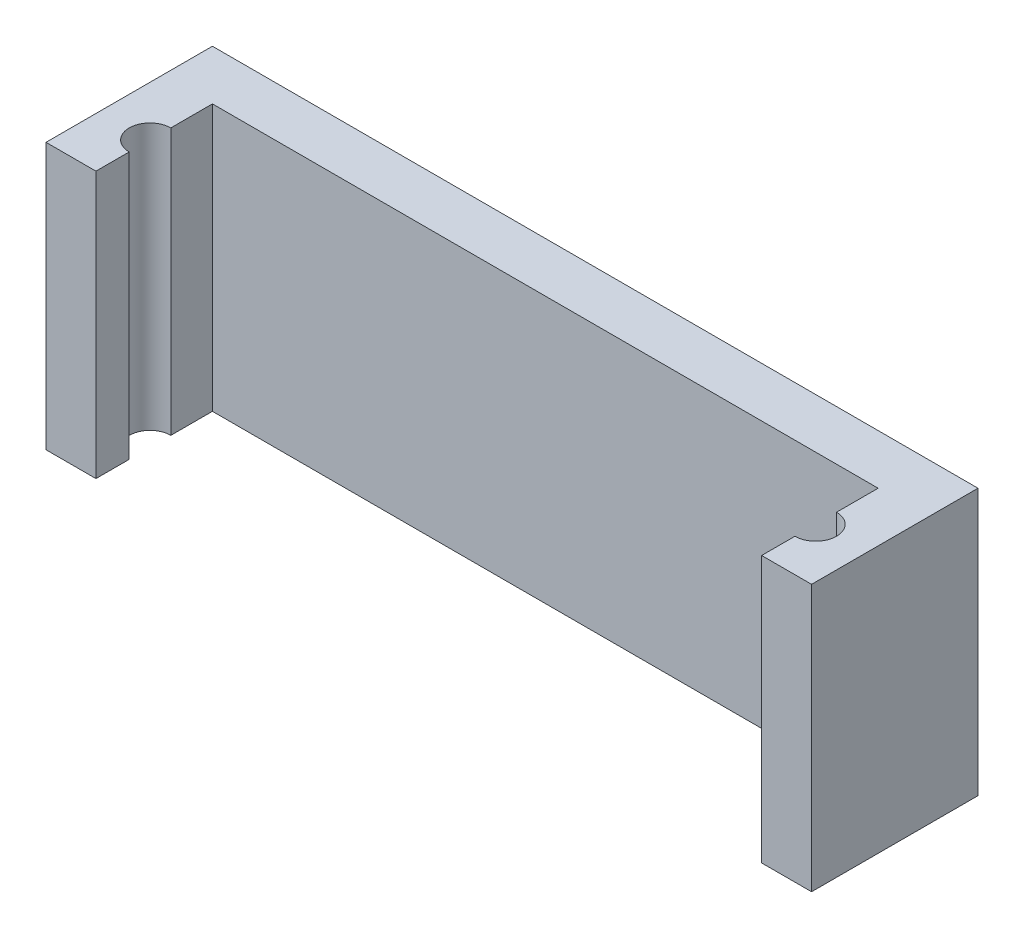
ISO-10303-21;
HEADER;
FILE_DESCRIPTION(('STEP AP214'),'2;1');
FILE_NAME('part.step','',(''),(''),'','','');
FILE_SCHEMA(('AUTOMOTIVE_DESIGN { 1 0 10303 214 1 1 1 1 }'));
ENDSEC;
DATA;
#1=APPLICATION_CONTEXT('core data for automotive mechanical design processes');
#2=APPLICATION_PROTOCOL_DEFINITION('international standard','automotive_design',2000,#1);
#3=PRODUCT_CONTEXT('',#1,'mechanical');
#4=PRODUCT('Part','Part','',(#3));
#5=PRODUCT_RELATED_PRODUCT_CATEGORY('part','',(#4));
#6=PRODUCT_DEFINITION_FORMATION('','',#4);
#7=PRODUCT_DEFINITION_CONTEXT('part definition',#1,'design');
#8=PRODUCT_DEFINITION('design','',#6,#7);
#9=PRODUCT_DEFINITION_SHAPE('','',#8);
#10=(LENGTH_UNIT() NAMED_UNIT(*) SI_UNIT(.MILLI.,.METRE.));
#11=(NAMED_UNIT(*) PLANE_ANGLE_UNIT() SI_UNIT($,.RADIAN.));
#12=(NAMED_UNIT(*) SI_UNIT($,.STERADIAN.) SOLID_ANGLE_UNIT());
#13=UNCERTAINTY_MEASURE_WITH_UNIT(LENGTH_MEASURE(1.E-05),#10,'distance_accuracy_value','');
#14=(GEOMETRIC_REPRESENTATION_CONTEXT(3) GLOBAL_UNCERTAINTY_ASSIGNED_CONTEXT((#13)) GLOBAL_UNIT_ASSIGNED_CONTEXT((#10,
#11,#12)) REPRESENTATION_CONTEXT('',''));
#15=CARTESIAN_POINT('',(0.,0.,0.));
#16=DIRECTION('',(0.,0.,1.));
#17=DIRECTION('',(1.,0.,0.));
#18=AXIS2_PLACEMENT_3D('',#15,#16,#17);
#19=CARTESIAN_POINT('',(1.905,10.16,1.27));
#20=DIRECTION('',(0.,0.,-1.));
#21=DIRECTION('',(-1.,0.,0.));
#22=AXIS2_PLACEMENT_3D('',#19,#20,#21);
#23=PLANE('',#22);
#24=DIRECTION('',(1.,0.,0.));
#25=VECTOR('',#24,1.);
#26=CARTESIAN_POINT('',(1.905,0.,1.27));
#27=LINE('',#26,#25);
#28=CARTESIAN_POINT('',(0.,0.,1.27));
#29=VERTEX_POINT('',#28);
#30=CARTESIAN_POINT('',(1.905,0.,1.27));
#31=VERTEX_POINT('',#30);
#32=EDGE_CURVE('E129',#29,#31,#27,.T.);
#33=ORIENTED_EDGE('',*,*,#32,.T.);
#34=DIRECTION('',(0.,-1.,0.));
#35=VECTOR('',#34,1.);
#36=CARTESIAN_POINT('',(1.905,10.16,1.27));
#37=LINE('',#36,#35);
#38=CARTESIAN_POINT('',(1.905,10.16,1.27));
#39=VERTEX_POINT('',#38);
#40=EDGE_CURVE('E38',#39,#31,#37,.T.);
#41=ORIENTED_EDGE('',*,*,#40,.F.);
#42=DIRECTION('',(1.,0.,0.));
#43=VECTOR('',#42,1.);
#44=CARTESIAN_POINT('',(1.905,10.16,1.27));
#45=LINE('',#44,#43);
#46=CARTESIAN_POINT('',(0.,10.16,1.27));
#47=VERTEX_POINT('',#46);
#48=EDGE_CURVE('E137',#47,#39,#45,.T.);
#49=ORIENTED_EDGE('',*,*,#48,.F.);
#50=DIRECTION('',(0.,-1.,0.));
#51=VECTOR('',#50,1.);
#52=CARTESIAN_POINT('',(0.,10.16,1.27));
#53=LINE('',#52,#51);
#54=EDGE_CURVE('E11',#47,#29,#53,.T.);
#55=ORIENTED_EDGE('',*,*,#54,.T.);
#56=EDGE_LOOP('',(#33,#41,#49,#55));
#57=FACE_BOUND('',#56,.T.);
#58=ADVANCED_FACE('F31',(#57),#23,.F.);
#59=CARTESIAN_POINT('',(1.905,10.16,0.));
#60=DIRECTION('',(-1.,0.,0.));
#61=DIRECTION('',(0.,0.,1.));
#62=AXIS2_PLACEMENT_3D('',#59,#60,#61);
#63=PLANE('',#62);
#64=DIRECTION('',(0.,0.,-1.));
#65=VECTOR('',#64,1.);
#66=CARTESIAN_POINT('',(1.905,0.,0.));
#67=LINE('',#66,#65);
#68=CARTESIAN_POINT('',(1.905,0.,0.));
#69=VERTEX_POINT('',#68);
#70=EDGE_CURVE('E132',#31,#69,#67,.T.);
#71=ORIENTED_EDGE('',*,*,#70,.T.);
#72=DIRECTION('',(0.,-1.,0.));
#73=VECTOR('',#72,1.);
#74=CARTESIAN_POINT('',(1.905,10.16,0.));
#75=LINE('',#74,#73);
#76=CARTESIAN_POINT('',(1.905,10.16,0.));
#77=VERTEX_POINT('',#76);
#78=EDGE_CURVE('E189',#77,#69,#75,.T.);
#79=ORIENTED_EDGE('',*,*,#78,.F.);
#80=DIRECTION('',(0.,0.,-1.));
#81=VECTOR('',#80,1.);
#82=CARTESIAN_POINT('',(1.905,10.16,0.));
#83=LINE('',#82,#81);
#84=EDGE_CURVE('E139',#39,#77,#83,.T.);
#85=ORIENTED_EDGE('',*,*,#84,.F.);
#86=ORIENTED_EDGE('',*,*,#40,.T.);
#87=EDGE_LOOP('',(#71,#79,#85,#86));
#88=FACE_BOUND('',#87,.T.);
#89=ADVANCED_FACE('F192',(#88),#63,.F.);
#90=CARTESIAN_POINT('',(1.905,10.16,-0.793750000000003));
#91=DIRECTION('',(0.,-1.,0.));
#92=DIRECTION('',(0.,0.,-1.));
#93=AXIS2_PLACEMENT_3D('',#90,#91,#92);
#94=CYLINDRICAL_SURFACE('',#93,0.793750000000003);
#95=CARTESIAN_POINT('',(1.905,0.,-0.793750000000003));
#96=DIRECTION('',(0.,-1.,0.));
#97=DIRECTION('',(0.,0.,1.));
#98=AXIS2_PLACEMENT_3D('',#95,#96,#97);
#99=CIRCLE('',#98,0.793750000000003);
#100=CARTESIAN_POINT('',(1.905,0.,-1.58750000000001));
#101=VERTEX_POINT('',#100);
#102=EDGE_CURVE('E200',#69,#101,#99,.T.);
#103=ORIENTED_EDGE('',*,*,#102,.T.);
#104=DIRECTION('',(0.,-1.,0.));
#105=VECTOR('',#104,1.);
#106=CARTESIAN_POINT('',(1.905,10.16,-1.58750000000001));
#107=LINE('',#106,#105);
#108=CARTESIAN_POINT('',(1.905,10.16,-1.58750000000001));
#109=VERTEX_POINT('',#108);
#110=EDGE_CURVE('E186',#109,#101,#107,.T.);
#111=ORIENTED_EDGE('',*,*,#110,.F.);
#112=CARTESIAN_POINT('',(1.905,10.16,-0.793750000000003));
#113=DIRECTION('',(0.,-1.,0.));
#114=DIRECTION('',(0.,0.,1.));
#115=AXIS2_PLACEMENT_3D('',#112,#113,#114);
#116=CIRCLE('',#115,0.793750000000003);
#117=EDGE_CURVE('E148',#77,#109,#116,.T.);
#118=ORIENTED_EDGE('',*,*,#117,.F.);
#119=ORIENTED_EDGE('',*,*,#78,.T.);
#120=EDGE_LOOP('',(#103,#111,#118,#119));
#121=FACE_BOUND('',#120,.T.);
#122=ADVANCED_FACE('F199',(#121),#94,.F.);
#123=CARTESIAN_POINT('',(1.905,10.16,-1.58750000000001));
#124=DIRECTION('',(-1.,0.,0.));
#125=DIRECTION('',(0.,0.,1.));
#126=AXIS2_PLACEMENT_3D('',#123,#124,#125);
#127=PLANE('',#126);
#128=DIRECTION('',(0.,0.,-1.));
#129=VECTOR('',#128,1.);
#130=CARTESIAN_POINT('',(1.905,0.,-1.58750000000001));
#131=LINE('',#130,#129);
#132=CARTESIAN_POINT('',(1.905,0.,-3.175));
#133=VERTEX_POINT('',#132);
#134=EDGE_CURVE('E205',#101,#133,#131,.T.);
#135=ORIENTED_EDGE('',*,*,#134,.T.);
#136=DIRECTION('',(0.,-1.,0.));
#137=VECTOR('',#136,1.);
#138=CARTESIAN_POINT('',(1.905,10.16,-3.175));
#139=LINE('',#138,#137);
#140=CARTESIAN_POINT('',(1.905,10.16,-3.175));
#141=VERTEX_POINT('',#140);
#142=EDGE_CURVE('E183',#141,#133,#139,.T.);
#143=ORIENTED_EDGE('',*,*,#142,.F.);
#144=DIRECTION('',(0.,0.,-1.));
#145=VECTOR('',#144,1.);
#146=CARTESIAN_POINT('',(1.905,10.16,-1.58750000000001));
#147=LINE('',#146,#145);
#148=EDGE_CURVE('E150',#109,#141,#147,.T.);
#149=ORIENTED_EDGE('',*,*,#148,.F.);
#150=ORIENTED_EDGE('',*,*,#110,.T.);
#151=EDGE_LOOP('',(#135,#143,#149,#150));
#152=FACE_BOUND('',#151,.T.);
#153=ADVANCED_FACE('F203',(#152),#127,.F.);
#154=CARTESIAN_POINT('',(1.905,10.16,-3.175));
#155=DIRECTION('',(0.,0.,-1.));
#156=DIRECTION('',(-1.,0.,0.));
#157=AXIS2_PLACEMENT_3D('',#154,#155,#156);
#158=PLANE('',#157);
#159=DIRECTION('',(1.,0.,0.));
#160=VECTOR('',#159,1.);
#161=CARTESIAN_POINT('',(1.905,0.,-3.175));
#162=LINE('',#161,#160);
#163=CARTESIAN_POINT('',(27.305,0.,-3.175));
#164=VERTEX_POINT('',#163);
#165=EDGE_CURVE('E246',#133,#164,#162,.T.);
#166=ORIENTED_EDGE('',*,*,#165,.T.);
#167=DIRECTION('',(0.,-1.,0.));
#168=VECTOR('',#167,1.);
#169=CARTESIAN_POINT('',(27.305,10.16,-3.175));
#170=LINE('',#169,#168);
#171=CARTESIAN_POINT('',(27.305,10.16,-3.175));
#172=VERTEX_POINT('',#171);
#173=EDGE_CURVE('E180',#172,#164,#170,.T.);
#174=ORIENTED_EDGE('',*,*,#173,.F.);
#175=DIRECTION('',(1.,0.,0.));
#176=VECTOR('',#175,1.);
#177=CARTESIAN_POINT('',(1.905,10.16,-3.175));
#178=LINE('',#177,#176);
#179=EDGE_CURVE('E152',#141,#172,#178,.T.);
#180=ORIENTED_EDGE('',*,*,#179,.F.);
#181=ORIENTED_EDGE('',*,*,#142,.T.);
#182=EDGE_LOOP('',(#166,#174,#180,#181));
#183=FACE_BOUND('',#182,.T.);
#184=ADVANCED_FACE('F209',(#183),#158,.F.);
#185=CARTESIAN_POINT('',(27.305,10.16,-1.58750000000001));
#186=DIRECTION('',(1.,0.,0.));
#187=DIRECTION('',(0.,0.,-1.));
#188=AXIS2_PLACEMENT_3D('',#185,#186,#187);
#189=PLANE('',#188);
#190=DIRECTION('',(0.,0.,1.));
#191=VECTOR('',#190,1.);
#192=CARTESIAN_POINT('',(27.305,0.,-1.58750000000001));
#193=LINE('',#192,#191);
#194=CARTESIAN_POINT('',(27.305,0.,-1.58750000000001));
#195=VERTEX_POINT('',#194);
#196=EDGE_CURVE('E217',#164,#195,#193,.T.);
#197=ORIENTED_EDGE('',*,*,#196,.T.);
#198=DIRECTION('',(0.,-1.,0.));
#199=VECTOR('',#198,1.);
#200=CARTESIAN_POINT('',(27.305,10.16,-1.58750000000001));
#201=LINE('',#200,#199);
#202=CARTESIAN_POINT('',(27.305,10.16,-1.58750000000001));
#203=VERTEX_POINT('',#202);
#204=EDGE_CURVE('E177',#203,#195,#201,.T.);
#205=ORIENTED_EDGE('',*,*,#204,.F.);
#206=DIRECTION('',(0.,0.,1.));
#207=VECTOR('',#206,1.);
#208=CARTESIAN_POINT('',(27.305,10.16,-1.58750000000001));
#209=LINE('',#208,#207);
#210=EDGE_CURVE('E154',#172,#203,#209,.T.);
#211=ORIENTED_EDGE('',*,*,#210,.F.);
#212=ORIENTED_EDGE('',*,*,#173,.T.);
#213=EDGE_LOOP('',(#197,#205,#211,#212));
#214=FACE_BOUND('',#213,.T.);
#215=ADVANCED_FACE('F215',(#214),#189,.F.);
#216=CARTESIAN_POINT('',(27.305,10.16,-0.793750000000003));
#217=DIRECTION('',(0.,-1.,0.));
#218=DIRECTION('',(0.,0.,-1.));
#219=AXIS2_PLACEMENT_3D('',#216,#217,#218);
#220=CYLINDRICAL_SURFACE('',#219,0.793750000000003);
#221=CARTESIAN_POINT('',(27.305,0.,-0.793750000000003));
#222=DIRECTION('',(0.,-1.,0.));
#223=DIRECTION('',(0.,0.,-1.));
#224=AXIS2_PLACEMENT_3D('',#221,#222,#223);
#225=CIRCLE('',#224,0.793750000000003);
#226=CARTESIAN_POINT('',(27.305,0.,0.));
#227=VERTEX_POINT('',#226);
#228=EDGE_CURVE('E222',#195,#227,#225,.T.);
#229=ORIENTED_EDGE('',*,*,#228,.T.);
#230=DIRECTION('',(0.,-1.,0.));
#231=VECTOR('',#230,1.);
#232=CARTESIAN_POINT('',(27.305,10.16,0.));
#233=LINE('',#232,#231);
#234=CARTESIAN_POINT('',(27.305,10.16,0.));
#235=VERTEX_POINT('',#234);
#236=EDGE_CURVE('E174',#235,#227,#233,.T.);
#237=ORIENTED_EDGE('',*,*,#236,.F.);
#238=CARTESIAN_POINT('',(27.305,10.16,-0.793750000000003));
#239=DIRECTION('',(0.,-1.,0.));
#240=DIRECTION('',(0.,0.,-1.));
#241=AXIS2_PLACEMENT_3D('',#238,#239,#240);
#242=CIRCLE('',#241,0.793750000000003);
#243=EDGE_CURVE('E156',#203,#235,#242,.T.);
#244=ORIENTED_EDGE('',*,*,#243,.F.);
#245=ORIENTED_EDGE('',*,*,#204,.T.);
#246=EDGE_LOOP('',(#229,#237,#244,#245));
#247=FACE_BOUND('',#246,.T.);
#248=ADVANCED_FACE('F220',(#247),#220,.F.);
#249=CARTESIAN_POINT('',(27.305,10.16,0.));
#250=DIRECTION('',(1.,0.,0.));
#251=DIRECTION('',(0.,0.,-1.));
#252=AXIS2_PLACEMENT_3D('',#249,#250,#251);
#253=PLANE('',#252);
#254=DIRECTION('',(0.,0.,1.));
#255=VECTOR('',#254,1.);
#256=CARTESIAN_POINT('',(27.305,0.,0.));
#257=LINE('',#256,#255);
#258=CARTESIAN_POINT('',(27.305,0.,1.27));
#259=VERTEX_POINT('',#258);
#260=EDGE_CURVE('E242',#227,#259,#257,.T.);
#261=ORIENTED_EDGE('',*,*,#260,.T.);
#262=DIRECTION('',(0.,-1.,0.));
#263=VECTOR('',#262,1.);
#264=CARTESIAN_POINT('',(27.305,10.16,1.27));
#265=LINE('',#264,#263);
#266=CARTESIAN_POINT('',(27.305,10.16,1.27));
#267=VERTEX_POINT('',#266);
#268=EDGE_CURVE('E171',#267,#259,#265,.T.);
#269=ORIENTED_EDGE('',*,*,#268,.F.);
#270=DIRECTION('',(0.,0.,1.));
#271=VECTOR('',#270,1.);
#272=CARTESIAN_POINT('',(27.305,10.16,0.));
#273=LINE('',#272,#271);
#274=EDGE_CURVE('E158',#235,#267,#273,.T.);
#275=ORIENTED_EDGE('',*,*,#274,.F.);
#276=ORIENTED_EDGE('',*,*,#236,.T.);
#277=EDGE_LOOP('',(#261,#269,#275,#276));
#278=FACE_BOUND('',#277,.T.);
#279=ADVANCED_FACE('F226',(#278),#253,.F.);
#280=CARTESIAN_POINT('',(27.305,10.16,1.27));
#281=DIRECTION('',(0.,0.,-1.));
#282=DIRECTION('',(-1.,0.,0.));
#283=AXIS2_PLACEMENT_3D('',#280,#281,#282);
#284=PLANE('',#283);
#285=DIRECTION('',(1.,0.,0.));
#286=VECTOR('',#285,1.);
#287=CARTESIAN_POINT('',(27.305,0.,1.27));
#288=LINE('',#287,#286);
#289=CARTESIAN_POINT('',(29.21,0.,1.27));
#290=VERTEX_POINT('',#289);
#291=EDGE_CURVE('E233',#259,#290,#288,.T.);
#292=ORIENTED_EDGE('',*,*,#291,.T.);
#293=DIRECTION('',(0.,-1.,0.));
#294=VECTOR('',#293,1.);
#295=CARTESIAN_POINT('',(29.21,10.16,1.27));
#296=LINE('',#295,#294);
#297=CARTESIAN_POINT('',(29.21,10.16,1.27));
#298=VERTEX_POINT('',#297);
#299=EDGE_CURVE('E168',#298,#290,#296,.T.);
#300=ORIENTED_EDGE('',*,*,#299,.F.);
#301=DIRECTION('',(1.,0.,0.));
#302=VECTOR('',#301,1.);
#303=CARTESIAN_POINT('',(27.305,10.16,1.27));
#304=LINE('',#303,#302);
#305=EDGE_CURVE('E160',#267,#298,#304,.T.);
#306=ORIENTED_EDGE('',*,*,#305,.F.);
#307=ORIENTED_EDGE('',*,*,#268,.T.);
#308=EDGE_LOOP('',(#292,#300,#306,#307));
#309=FACE_BOUND('',#308,.T.);
#310=ADVANCED_FACE('F231',(#309),#284,.F.);
#311=CARTESIAN_POINT('',(29.21,10.16,0.));
#312=DIRECTION('',(-1.,0.,0.));
#313=DIRECTION('',(0.,0.,1.));
#314=AXIS2_PLACEMENT_3D('',#311,#312,#313);
#315=PLANE('',#314);
#316=DIRECTION('',(0.,0.,-1.));
#317=VECTOR('',#316,1.);
#318=CARTESIAN_POINT('',(29.21,0.,0.));
#319=LINE('',#318,#317);
#320=CARTESIAN_POINT('',(29.21,0.,-5.08));
#321=VERTEX_POINT('',#320);
#322=EDGE_CURVE('E236',#290,#321,#319,.T.);
#323=ORIENTED_EDGE('',*,*,#322,.T.);
#324=DIRECTION('',(0.,-1.,0.));
#325=VECTOR('',#324,1.);
#326=CARTESIAN_POINT('',(29.21,10.16,-5.08));
#327=LINE('',#326,#325);
#328=CARTESIAN_POINT('',(29.21,10.16,-5.08));
#329=VERTEX_POINT('',#328);
#330=EDGE_CURVE('E165',#329,#321,#327,.T.);
#331=ORIENTED_EDGE('',*,*,#330,.F.);
#332=DIRECTION('',(0.,0.,-1.));
#333=VECTOR('',#332,1.);
#334=CARTESIAN_POINT('',(29.21,10.16,1.27));
#335=LINE('',#334,#333);
#336=EDGE_CURVE('E52',#298,#329,#335,.T.);
#337=ORIENTED_EDGE('',*,*,#336,.F.);
#338=ORIENTED_EDGE('',*,*,#299,.T.);
#339=EDGE_LOOP('',(#323,#331,#337,#338));
#340=FACE_BOUND('',#339,.T.);
#341=ADVANCED_FACE('F235',(#340),#315,.F.);
#342=CARTESIAN_POINT('',(0.,10.16,-5.08));
#343=DIRECTION('',(0.,0.,1.));
#344=DIRECTION('',(1.,0.,0.));
#345=AXIS2_PLACEMENT_3D('',#342,#343,#344);
#346=PLANE('',#345);
#347=DIRECTION('',(-1.,0.,0.));
#348=VECTOR('',#347,1.);
#349=CARTESIAN_POINT('',(0.,0.,-5.08));
#350=LINE('',#349,#348);
#351=CARTESIAN_POINT('',(0.,0.,-5.08));
#352=VERTEX_POINT('',#351);
#353=EDGE_CURVE('E126',#321,#352,#350,.T.);
#354=ORIENTED_EDGE('',*,*,#353,.T.);
#355=DIRECTION('',(0.,-1.,0.));
#356=VECTOR('',#355,1.);
#357=CARTESIAN_POINT('',(0.,10.16,-5.08));
#358=LINE('',#357,#356);
#359=CARTESIAN_POINT('',(0.,10.16,-5.08));
#360=VERTEX_POINT('',#359);
#361=EDGE_CURVE('E123',#360,#352,#358,.T.);
#362=ORIENTED_EDGE('',*,*,#361,.F.);
#363=DIRECTION('',(-1.,0.,0.));
#364=VECTOR('',#363,1.);
#365=CARTESIAN_POINT('',(0.,10.16,-5.08));
#366=LINE('',#365,#364);
#367=EDGE_CURVE('E143',#329,#360,#366,.T.);
#368=ORIENTED_EDGE('',*,*,#367,.F.);
#369=ORIENTED_EDGE('',*,*,#330,.T.);
#370=EDGE_LOOP('',(#354,#362,#368,#369));
#371=FACE_BOUND('',#370,.T.);
#372=ADVANCED_FACE('F238',(#371),#346,.F.);
#373=CARTESIAN_POINT('',(0.,10.16,0.));
#374=DIRECTION('',(1.,0.,0.));
#375=DIRECTION('',(0.,0.,-1.));
#376=AXIS2_PLACEMENT_3D('',#373,#374,#375);
#377=PLANE('',#376);
#378=DIRECTION('',(0.,0.,1.));
#379=VECTOR('',#378,1.);
#380=CARTESIAN_POINT('',(0.,0.,0.));
#381=LINE('',#380,#379);
#382=EDGE_CURVE('E119',#352,#29,#381,.T.);
#383=ORIENTED_EDGE('',*,*,#382,.T.);
#384=ORIENTED_EDGE('',*,*,#54,.F.);
#385=DIRECTION('',(0.,0.,1.));
#386=VECTOR('',#385,1.);
#387=CARTESIAN_POINT('',(0.,10.16,1.27));
#388=LINE('',#387,#386);
#389=EDGE_CURVE('E45',#360,#47,#388,.T.);
#390=ORIENTED_EDGE('',*,*,#389,.F.);
#391=ORIENTED_EDGE('',*,*,#361,.T.);
#392=EDGE_LOOP('',(#383,#384,#390,#391));
#393=FACE_BOUND('',#392,.T.);
#394=ADVANCED_FACE('F121',(#393),#377,.F.);
#395=CARTESIAN_POINT('',(27.305,10.16,-0.793750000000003));
#396=DIRECTION('',(0.,-1.,0.));
#397=DIRECTION('',(0.,0.,-1.));
#398=AXIS2_PLACEMENT_3D('',#395,#396,#397);
#399=PLANE('',#398);
#400=ORIENTED_EDGE('',*,*,#389,.T.);
#401=ORIENTED_EDGE('',*,*,#48,.T.);
#402=ORIENTED_EDGE('',*,*,#84,.T.);
#403=ORIENTED_EDGE('',*,*,#117,.T.);
#404=ORIENTED_EDGE('',*,*,#148,.T.);
#405=ORIENTED_EDGE('',*,*,#179,.T.);
#406=ORIENTED_EDGE('',*,*,#210,.T.);
#407=ORIENTED_EDGE('',*,*,#243,.T.);
#408=ORIENTED_EDGE('',*,*,#274,.T.);
#409=ORIENTED_EDGE('',*,*,#305,.T.);
#410=ORIENTED_EDGE('',*,*,#336,.T.);
#411=ORIENTED_EDGE('',*,*,#367,.T.);
#412=EDGE_LOOP('',(#400,#401,#402,#403,#404,#405,#406,#407,#408,#409,#410,#411));
#413=FACE_BOUND('',#412,.T.);
#414=ADVANCED_FACE('F141',(#413),#399,.F.);
#415=CARTESIAN_POINT('',(27.305,0.,-0.793750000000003));
#416=DIRECTION('',(0.,-1.,0.));
#417=DIRECTION('',(0.,0.,-1.));
#418=AXIS2_PLACEMENT_3D('',#415,#416,#417);
#419=PLANE('',#418);
#420=ORIENTED_EDGE('',*,*,#32,.F.);
#421=ORIENTED_EDGE('',*,*,#382,.F.);
#422=ORIENTED_EDGE('',*,*,#353,.F.);
#423=ORIENTED_EDGE('',*,*,#322,.F.);
#424=ORIENTED_EDGE('',*,*,#291,.F.);
#425=ORIENTED_EDGE('',*,*,#260,.F.);
#426=ORIENTED_EDGE('',*,*,#228,.F.);
#427=ORIENTED_EDGE('',*,*,#196,.F.);
#428=ORIENTED_EDGE('',*,*,#165,.F.);
#429=ORIENTED_EDGE('',*,*,#134,.F.);
#430=ORIENTED_EDGE('',*,*,#102,.F.);
#431=ORIENTED_EDGE('',*,*,#70,.F.);
#432=EDGE_LOOP('',(#420,#421,#422,#423,#424,#425,#426,#427,#428,#429,#430,#431));
#433=FACE_BOUND('',#432,.T.);
#434=ADVANCED_FACE('F130',(#433),#419,.T.);
#435=CLOSED_SHELL('',(#58,#89,#122,#153,#184,#215,#248,#279,#310,#341,#372,#394,#414,#434));
#436=MANIFOLD_SOLID_BREP('B2',#435);
#437=ADVANCED_BREP_SHAPE_REPRESENTATION('',(#18,#436),#14);
#438=SHAPE_DEFINITION_REPRESENTATION(#9,#437);
ENDSEC;
END-ISO-10303-21;
